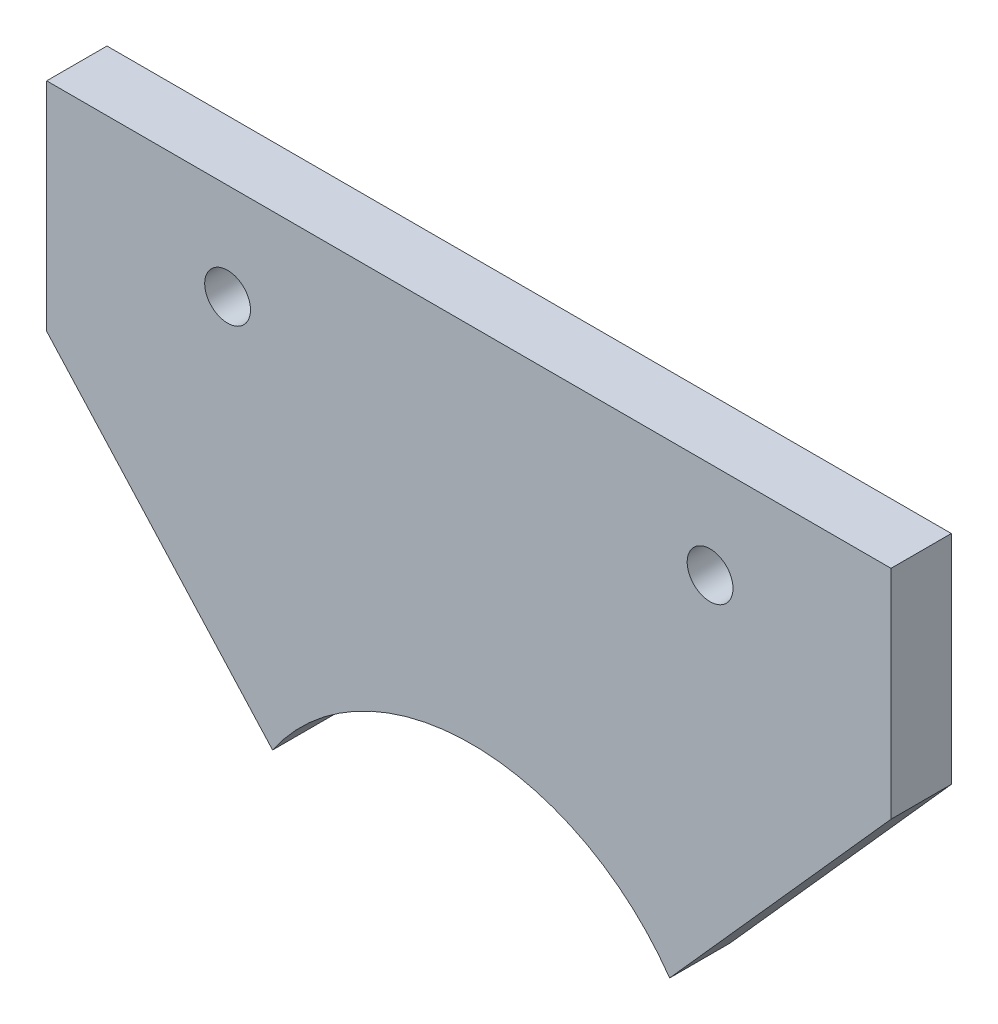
from build123d import *

# Parameters (mm, degrees)
SKETCH1_W             = 70
SKETCH1_H             = 50
BOSS_EXTRUDE1_DEPTH   = 5
F_6_CLEARANCE_HOLE1_D = 3.7973
CUT_EXTRUDE1_DEPTH    = 44.301270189
SKETCH5_R             = 20
CUT_EXTRUDE2_DEPTH    = 44.301270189


with BuildPart() as part:
    # Sketch1 → Boss-Extrude1 (new body)
    with BuildSketch(Plane.XY):
        Rectangle(SKETCH1_W, SKETCH1_H)
    extrude(amount=BOSS_EXTRUDE1_DEPTH)

    # 6 Clearance Hole1 (through all)
    with Locations(Plane.XY.offset(5)):
        with Locations((-20, 17), (20, 17)):
            Hole(F_6_CLEARANCE_HOLE1_D / 2)

    # Sketch4 → Cut-Extrude1 (cut, through all)
    with BuildSketch(Plane.XY.offset(5)):
        Polygon((-54.86007416, -6.902215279), (-21.572027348, -43.694267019), (-3.726666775, -27.548464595), (-37.014713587, 9.243587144), align=None)
        Polygon((37.014713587, 9.243587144), (4.920873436, -26.737752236), (23.184391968, -43.028041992), (55.278232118, -7.046702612), align=None)
    extrude(amount=-CUT_EXTRUDE1_DEPTH, mode=Mode.SUBTRACT)

    # Sketch5 → Cut-Extrude2 (cut, through all)
    with BuildSketch(Plane.XY.offset(5)):
        with Locations((0.219227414, -25)):
            Circle(SKETCH5_R)
    extrude(amount=-CUT_EXTRUDE2_DEPTH, mode=Mode.SUBTRACT)


solid = part.part
